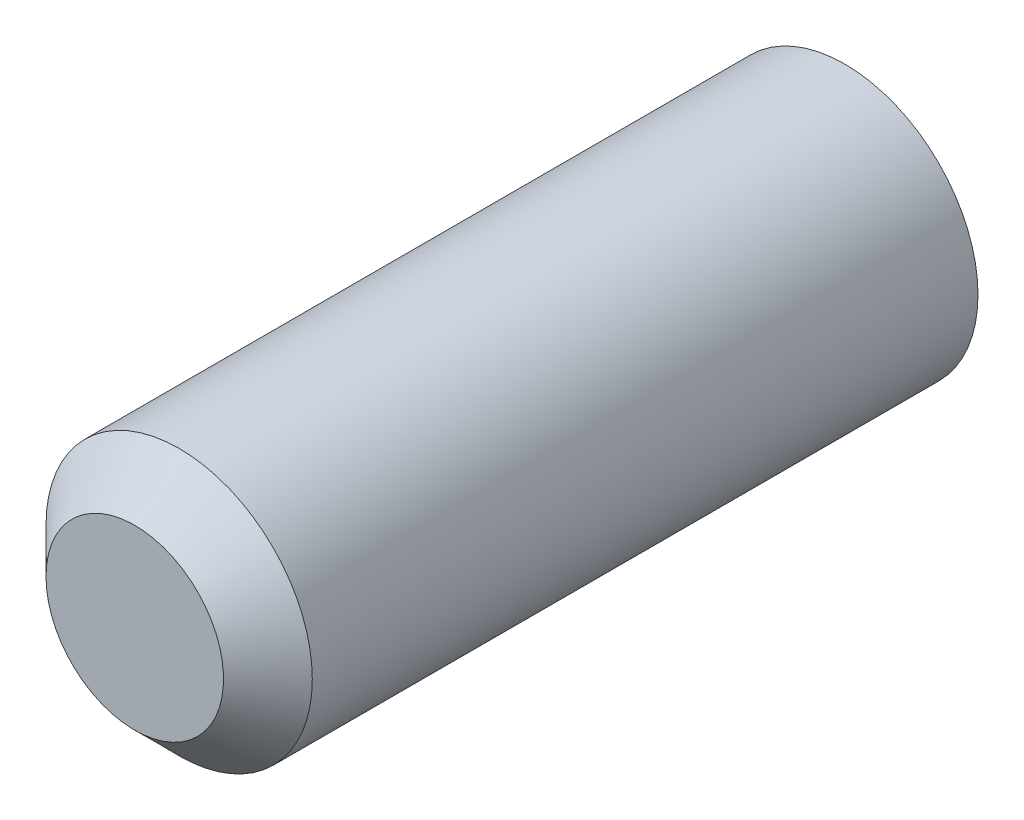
ISO-10303-21;
HEADER;
FILE_DESCRIPTION(('STEP AP214'),'2;1');
FILE_NAME('part.step','',(''),(''),'','','');
FILE_SCHEMA(('AUTOMOTIVE_DESIGN { 1 0 10303 214 1 1 1 1 }'));
ENDSEC;
DATA;
#1=APPLICATION_CONTEXT('core data for automotive mechanical design processes');
#2=APPLICATION_PROTOCOL_DEFINITION('international standard','automotive_design',2000,#1);
#3=PRODUCT_CONTEXT('',#1,'mechanical');
#4=PRODUCT('Part','Part','',(#3));
#5=PRODUCT_RELATED_PRODUCT_CATEGORY('part','',(#4));
#6=PRODUCT_DEFINITION_FORMATION('','',#4);
#7=PRODUCT_DEFINITION_CONTEXT('part definition',#1,'design');
#8=PRODUCT_DEFINITION('design','',#6,#7);
#9=PRODUCT_DEFINITION_SHAPE('','',#8);
#10=(LENGTH_UNIT() NAMED_UNIT(*) SI_UNIT(.MILLI.,.METRE.));
#11=(NAMED_UNIT(*) PLANE_ANGLE_UNIT() SI_UNIT($,.RADIAN.));
#12=(NAMED_UNIT(*) SI_UNIT($,.STERADIAN.) SOLID_ANGLE_UNIT());
#13=UNCERTAINTY_MEASURE_WITH_UNIT(LENGTH_MEASURE(1.E-05),#10,'distance_accuracy_value','');
#14=(GEOMETRIC_REPRESENTATION_CONTEXT(3) GLOBAL_UNCERTAINTY_ASSIGNED_CONTEXT((#13)) GLOBAL_UNIT_ASSIGNED_CONTEXT((#10,
#11,#12)) REPRESENTATION_CONTEXT('',''));
#15=CARTESIAN_POINT('',(0.,0.,0.));
#16=DIRECTION('',(0.,0.,1.));
#17=DIRECTION('',(1.,0.,0.));
#18=AXIS2_PLACEMENT_3D('',#15,#16,#17);
#19=CARTESIAN_POINT('',(0.,0.,25.4));
#20=DIRECTION('',(0.,0.,-1.));
#21=DIRECTION('',(-1.,0.,0.));
#22=AXIS2_PLACEMENT_3D('',#19,#20,#21);
#23=CYLINDRICAL_SURFACE('',#22,4.7625);
#24=CARTESIAN_POINT('',(0.,0.,23.8125));
#25=DIRECTION('',(0.,0.,1.));
#26=DIRECTION('',(1.,0.,0.));
#27=AXIS2_PLACEMENT_3D('',#24,#25,#26);
#28=CIRCLE('',#27,4.7625);
#29=CARTESIAN_POINT('',(-4.7625,0.,23.8125));
#30=VERTEX_POINT('',#29);
#31=EDGE_CURVE('E10',#30,#30,#28,.F.);
#32=ORIENTED_EDGE('',*,*,#31,.T.);
#33=EDGE_LOOP('',(#32));
#34=FACE_BOUND('',#33,.T.);
#35=CARTESIAN_POINT('',(0.,0.,0.));
#36=DIRECTION('',(0.,0.,1.));
#37=DIRECTION('',(1.,0.,0.));
#38=AXIS2_PLACEMENT_3D('',#35,#36,#37);
#39=CIRCLE('',#38,4.7625);
#40=CARTESIAN_POINT('',(4.7625,0.,0.));
#41=VERTEX_POINT('',#40);
#42=EDGE_CURVE('E36',#41,#41,#39,.T.);
#43=ORIENTED_EDGE('',*,*,#42,.T.);
#44=EDGE_LOOP('',(#43));
#45=FACE_BOUND('',#44,.T.);
#46=ADVANCED_FACE('F26',(#34,#45),#23,.T.);
#47=CARTESIAN_POINT('',(0.,0.,25.4));
#48=DIRECTION('',(0.,0.,1.));
#49=DIRECTION('',(1.,0.,0.));
#50=AXIS2_PLACEMENT_3D('',#47,#48,#49);
#51=PLANE('',#50);
#52=CARTESIAN_POINT('',(0.,0.,25.4));
#53=DIRECTION('',(0.,0.,1.));
#54=DIRECTION('',(1.,0.,0.));
#55=AXIS2_PLACEMENT_3D('',#52,#53,#54);
#56=CIRCLE('',#55,3.175);
#57=CARTESIAN_POINT('',(-3.175,0.,25.4));
#58=VERTEX_POINT('',#57);
#59=EDGE_CURVE('E32',#58,#58,#56,.T.);
#60=ORIENTED_EDGE('',*,*,#59,.T.);
#61=EDGE_LOOP('',(#60));
#62=FACE_BOUND('',#61,.T.);
#63=ADVANCED_FACE('F47',(#62),#51,.T.);
#64=CARTESIAN_POINT('',(0.,0.,0.));
#65=DIRECTION('',(0.,0.,1.));
#66=DIRECTION('',(1.,0.,0.));
#67=AXIS2_PLACEMENT_3D('',#64,#65,#66);
#68=PLANE('',#67);
#69=ORIENTED_EDGE('',*,*,#42,.F.);
#70=EDGE_LOOP('',(#69));
#71=FACE_BOUND('',#70,.T.);
#72=ADVANCED_FACE('F44',(#71),#68,.F.);
#73=CARTESIAN_POINT('',(0.,0.,25.4));
#74=DIRECTION('',(0.,0.,-1.));
#75=DIRECTION('',(-1.,0.,0.));
#76=AXIS2_PLACEMENT_3D('',#73,#74,#75);
#77=CONICAL_SURFACE('',#76,3.175,0.785398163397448);
#78=CARTESIAN_POINT('',(-4.7625,0.,23.8125));
#79=CARTESIAN_POINT('',(-4.74596354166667,0.,23.8290364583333));
#80=CARTESIAN_POINT('',(-4.72942708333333,0.,23.8455729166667));
#81=CARTESIAN_POINT('',(-4.69635416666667,0.,23.8786458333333));
#82=CARTESIAN_POINT('',(-4.67981770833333,0.,23.8951822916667));
#83=CARTESIAN_POINT('',(-4.64674479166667,0.,23.9282552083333));
#84=CARTESIAN_POINT('',(-4.63020833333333,0.,23.9447916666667));
#85=CARTESIAN_POINT('',(-4.59713541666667,0.,23.9778645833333));
#86=CARTESIAN_POINT('',(-4.58059895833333,0.,23.9944010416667));
#87=CARTESIAN_POINT('',(-4.54752604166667,0.,24.0274739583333));
#88=CARTESIAN_POINT('',(-4.53098958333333,0.,24.0440104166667));
#89=CARTESIAN_POINT('',(-4.49791666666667,0.,24.0770833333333));
#90=CARTESIAN_POINT('',(-4.48138020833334,0.,24.0936197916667));
#91=CARTESIAN_POINT('',(-4.44830729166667,0.,24.1266927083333));
#92=CARTESIAN_POINT('',(-4.43177083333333,0.,24.1432291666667));
#93=CARTESIAN_POINT('',(-4.39869791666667,0.,24.1763020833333));
#94=CARTESIAN_POINT('',(-4.38216145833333,0.,24.1928385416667));
#95=CARTESIAN_POINT('',(-4.34908854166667,0.,24.2259114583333));
#96=CARTESIAN_POINT('',(-4.33255208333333,0.,24.2424479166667));
#97=CARTESIAN_POINT('',(-4.29947916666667,0.,24.2755208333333));
#98=CARTESIAN_POINT('',(-4.28294270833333,0.,24.2920572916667));
#99=CARTESIAN_POINT('',(-4.24986979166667,0.,24.3251302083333));
#100=CARTESIAN_POINT('',(-4.23333333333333,0.,24.3416666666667));
#101=CARTESIAN_POINT('',(-4.20026041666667,0.,24.3747395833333));
#102=CARTESIAN_POINT('',(-4.18372395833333,0.,24.3912760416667));
#103=CARTESIAN_POINT('',(-4.15065104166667,0.,24.4243489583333));
#104=CARTESIAN_POINT('',(-4.13411458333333,0.,24.4408854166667));
#105=CARTESIAN_POINT('',(-4.10104166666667,0.,24.4739583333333));
#106=CARTESIAN_POINT('',(-4.08450520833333,0.,24.4904947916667));
#107=CARTESIAN_POINT('',(-4.05143229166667,0.,24.5235677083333));
#108=CARTESIAN_POINT('',(-4.03489583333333,0.,24.5401041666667));
#109=CARTESIAN_POINT('',(-4.00182291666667,0.,24.5731770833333));
#110=CARTESIAN_POINT('',(-3.98528645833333,0.,24.5897135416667));
#111=CARTESIAN_POINT('',(-3.95221354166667,0.,24.6227864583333));
#112=CARTESIAN_POINT('',(-3.93567708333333,0.,24.6393229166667));
#113=CARTESIAN_POINT('',(-3.90260416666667,0.,24.6723958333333));
#114=CARTESIAN_POINT('',(-3.88606770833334,0.,24.6889322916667));
#115=CARTESIAN_POINT('',(-3.85299479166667,0.,24.7220052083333));
#116=CARTESIAN_POINT('',(-3.83645833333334,0.,24.7385416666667));
#117=CARTESIAN_POINT('',(-3.80338541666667,0.,24.7716145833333));
#118=CARTESIAN_POINT('',(-3.78684895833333,0.,24.7881510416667));
#119=CARTESIAN_POINT('',(-3.75377604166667,0.,24.8212239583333));
#120=CARTESIAN_POINT('',(-3.73723958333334,0.,24.8377604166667));
#121=CARTESIAN_POINT('',(-3.70416666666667,0.,24.8708333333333));
#122=CARTESIAN_POINT('',(-3.68763020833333,0.,24.8873697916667));
#123=CARTESIAN_POINT('',(-3.65455729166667,0.,24.9204427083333));
#124=CARTESIAN_POINT('',(-3.63802083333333,0.,24.9369791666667));
#125=CARTESIAN_POINT('',(-3.60494791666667,0.,24.9700520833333));
#126=CARTESIAN_POINT('',(-3.58841145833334,0.,24.9865885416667));
#127=CARTESIAN_POINT('',(-3.55533854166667,0.,25.0196614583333));
#128=CARTESIAN_POINT('',(-3.53880208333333,0.,25.0361979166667));
#129=CARTESIAN_POINT('',(-3.50572916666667,0.,25.0692708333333));
#130=CARTESIAN_POINT('',(-3.48919270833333,0.,25.0858072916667));
#131=CARTESIAN_POINT('',(-3.45611979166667,0.,25.1188802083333));
#132=CARTESIAN_POINT('',(-3.43958333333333,0.,25.1354166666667));
#133=CARTESIAN_POINT('',(-3.40651041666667,0.,25.1684895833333));
#134=CARTESIAN_POINT('',(-3.38997395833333,0.,25.1850260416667));
#135=CARTESIAN_POINT('',(-3.35690104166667,0.,25.2180989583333));
#136=CARTESIAN_POINT('',(-3.34036458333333,0.,25.2346354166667));
#137=CARTESIAN_POINT('',(-3.30729166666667,0.,25.2677083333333));
#138=CARTESIAN_POINT('',(-3.29075520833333,0.,25.2842447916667));
#139=CARTESIAN_POINT('',(-3.25768229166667,0.,25.3173177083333));
#140=CARTESIAN_POINT('',(-3.24114583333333,0.,25.3338541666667));
#141=CARTESIAN_POINT('',(-3.20807291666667,0.,25.3669270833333));
#142=CARTESIAN_POINT('',(-3.19153645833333,0.,25.3834635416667));
#143=CARTESIAN_POINT('',(-3.175,0.,25.4));
#144=B_SPLINE_CURVE_WITH_KNOTS('',3,(#78,#79,#80,#81,#82,#83,#84,#85,#86,#87,#88,#89,#90,#91,
#92,#93,#94,#95,#96,#97,#98,#99,#100,#101,#102,#103,#104,#105,#106,#107,#108,#109,#110,#111,
#112,#113,#114,#115,#116,#117,#118,#119,#120,#121,#122,#123,#124,#125,#126,#127,#128,#129,#130,
#131,#132,#133,#134,#135,#136,#137,#138,#139,#140,#141,#142,#143),.UNSPECIFIED.,.F.,.F.,(4,2,2,
2,2,2,2,2,2,2,2,2,2,2,2,2,2,2,2,2,2,2,2,2,2,2,2,2,2,2,2,2,4),(0.,0.0701582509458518,
0.140316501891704,0.210474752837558,0.28063300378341,0.350791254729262,0.420949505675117,
0.491107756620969,0.56126600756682,0.631424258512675,0.701582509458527,0.771740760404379,
0.841899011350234,0.912057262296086,0.982215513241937,1.05237376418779,1.12253201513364,
1.1926902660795,1.26284851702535,1.3330067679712,1.40316501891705,1.47332326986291,
1.54348152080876,1.61363977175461,1.68379802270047,1.75395627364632,1.82411452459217,
1.89427277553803,1.96443102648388,2.03458927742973,2.10474752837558,2.17490577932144,
2.24506403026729),.UNSPECIFIED.);
#145=EDGE_CURVE('BSEAM46',#30,#58,#144,.T.);
#146=ORIENTED_EDGE('',*,*,#31,.F.);
#147=ORIENTED_EDGE('',*,*,#59,.F.);
#148=ORIENTED_EDGE('',*,*,#145,.T.);
#149=ORIENTED_EDGE('',*,*,#145,.F.);
#150=EDGE_LOOP('',(#146,#148,#147,#149));
#151=FACE_BOUND('',#150,.T.);
#152=ADVANCED_FACE('F46',(#151),#77,.T.);
#153=CLOSED_SHELL('',(#46,#63,#72,#152));
#154=MANIFOLD_SOLID_BREP('B2',#153);
#155=ADVANCED_BREP_SHAPE_REPRESENTATION('',(#18,#154),#14);
#156=SHAPE_DEFINITION_REPRESENTATION(#9,#155);
ENDSEC;
END-ISO-10303-21;
